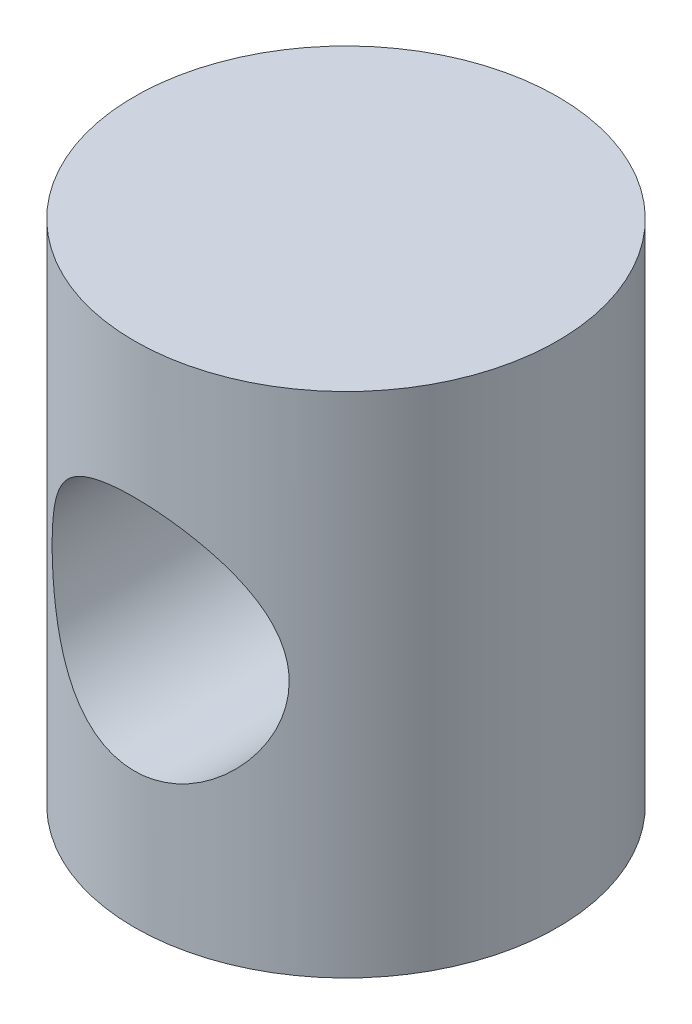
ISO-10303-21;
HEADER;
FILE_DESCRIPTION(('STEP AP214'),'2;1');
FILE_NAME('part.step','',(''),(''),'','','');
FILE_SCHEMA(('AUTOMOTIVE_DESIGN { 1 0 10303 214 1 1 1 1 }'));
ENDSEC;
DATA;
#1=APPLICATION_CONTEXT('core data for automotive mechanical design processes');
#2=APPLICATION_PROTOCOL_DEFINITION('international standard','automotive_design',2000,#1);
#3=PRODUCT_CONTEXT('',#1,'mechanical');
#4=PRODUCT('Part','Part','',(#3));
#5=PRODUCT_RELATED_PRODUCT_CATEGORY('part','',(#4));
#6=PRODUCT_DEFINITION_FORMATION('','',#4);
#7=PRODUCT_DEFINITION_CONTEXT('part definition',#1,'design');
#8=PRODUCT_DEFINITION('design','',#6,#7);
#9=PRODUCT_DEFINITION_SHAPE('','',#8);
#10=(LENGTH_UNIT() NAMED_UNIT(*) SI_UNIT(.MILLI.,.METRE.));
#11=(NAMED_UNIT(*) PLANE_ANGLE_UNIT() SI_UNIT($,.RADIAN.));
#12=(NAMED_UNIT(*) SI_UNIT($,.STERADIAN.) SOLID_ANGLE_UNIT());
#13=UNCERTAINTY_MEASURE_WITH_UNIT(LENGTH_MEASURE(1.E-05),#10,'distance_accuracy_value','');
#14=(GEOMETRIC_REPRESENTATION_CONTEXT(3) GLOBAL_UNCERTAINTY_ASSIGNED_CONTEXT((#13)) GLOBAL_UNIT_ASSIGNED_CONTEXT((#10,
#11,#12)) REPRESENTATION_CONTEXT('',''));
#15=CARTESIAN_POINT('',(0.,0.,0.));
#16=DIRECTION('',(0.,0.,1.));
#17=DIRECTION('',(1.,0.,0.));
#18=AXIS2_PLACEMENT_3D('',#15,#16,#17);
#19=CARTESIAN_POINT('',(0.,120.,0.));
#20=DIRECTION('',(0.,-1.,0.));
#21=DIRECTION('',(0.,0.,-1.));
#22=AXIS2_PLACEMENT_3D('',#19,#20,#21);
#23=CYLINDRICAL_SURFACE('',#22,50.);
#24=CARTESIAN_POINT('',(0.,88.,-50.));
#25=CARTESIAN_POINT('',(-0.725789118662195,88.0000033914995,-50.0000029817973));
#26=CARTESIAN_POINT('',(-1.45153575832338,87.9717506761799,-49.9841642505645));
#27=CARTESIAN_POINT('',(-2.89724829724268,87.8591375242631,-49.921231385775));
#28=CARTESIAN_POINT('',(-3.61721463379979,87.7747813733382,-49.8741396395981));
#29=CARTESIAN_POINT('',(-5.04594931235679,87.5510678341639,-49.7499015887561));
#30=CARTESIAN_POINT('',(-5.75471665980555,87.4117055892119,-49.6727526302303));
#31=CARTESIAN_POINT('',(-7.15594832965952,87.0797132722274,-49.4903187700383));
#32=CARTESIAN_POINT('',(-7.84841217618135,86.8870816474,-49.3850330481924));
#33=CARTESIAN_POINT('',(-9.20994156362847,86.4515776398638,-49.1492887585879));
#34=CARTESIAN_POINT('',(-9.87908556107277,86.2088976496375,-49.0189267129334));
#35=CARTESIAN_POINT('',(-11.1928842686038,85.6753204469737,-48.7357257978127));
#36=CARTESIAN_POINT('',(-11.83753920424,85.3844236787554,-48.5828871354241));
#37=CARTESIAN_POINT('',(-13.0992393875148,84.756947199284,-48.2579982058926));
#38=CARTESIAN_POINT('',(-13.7162810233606,84.4203615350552,-48.0859454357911));
#39=CARTESIAN_POINT('',(-14.9200130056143,83.7040882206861,-47.7261762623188));
#40=CARTESIAN_POINT('',(-15.5067019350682,83.3243985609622,-47.5384591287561));
#41=CARTESIAN_POINT('',(-16.6875519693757,82.4962562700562,-47.1374712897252));
#42=CARTESIAN_POINT('',(-17.2793451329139,82.044847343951,-46.92333181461));
#43=CARTESIAN_POINT('',(-18.4232468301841,81.0982277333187,-46.4861159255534));
#44=CARTESIAN_POINT('',(-18.9753538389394,80.6030153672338,-46.2630391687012));
#45=CARTESIAN_POINT('',(-20.0382856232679,79.5708061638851,-45.8126684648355));
#46=CARTESIAN_POINT('',(-20.5490700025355,79.0337694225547,-45.5853706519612));
#47=CARTESIAN_POINT('',(-21.5267247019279,77.9206281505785,-45.1319237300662));
#48=CARTESIAN_POINT('',(-21.993592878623,77.344521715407,-44.9057746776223));
#49=CARTESIAN_POINT('',(-22.9272591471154,76.0938237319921,-44.4369345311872));
#50=CARTESIAN_POINT('',(-23.3890459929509,75.4152109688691,-44.1949547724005));
#51=CARTESIAN_POINT('',(-24.2534189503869,74.0159890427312,-43.7265757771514));
#52=CARTESIAN_POINT('',(-24.6559971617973,73.2953742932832,-43.5001786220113));
#53=CARTESIAN_POINT('',(-25.3978852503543,71.816552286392,-43.0712303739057));
#54=CARTESIAN_POINT('',(-25.7372696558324,71.0583906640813,-42.8686512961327));
#55=CARTESIAN_POINT('',(-26.3493584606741,69.5081640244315,-42.4951769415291));
#56=CARTESIAN_POINT('',(-26.6220835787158,68.7161096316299,-42.3242718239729));
#57=CARTESIAN_POINT('',(-27.0462355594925,67.275874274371,-42.0541328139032));
#58=CARTESIAN_POINT('',(-27.2111271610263,66.633039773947,-41.9473870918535));
#59=CARTESIAN_POINT('',(-27.4953896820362,65.3334557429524,-41.7616149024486));
#60=CARTESIAN_POINT('',(-27.6147671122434,64.6767082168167,-41.6825844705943));
#61=CARTESIAN_POINT('',(-27.8064171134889,63.35400404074,-41.5549812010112));
#62=CARTESIAN_POINT('',(-27.8787301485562,62.6880558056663,-41.5063822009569));
#63=CARTESIAN_POINT('',(-27.975412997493,61.3510893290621,-41.4412801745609));
#64=CARTESIAN_POINT('',(-27.999781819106,60.6800709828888,-41.4247778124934));
#65=CARTESIAN_POINT('',(-28.0002155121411,59.3372353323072,-41.4244847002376));
#66=CARTESIAN_POINT('',(-27.9762244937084,58.6654180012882,-41.4407317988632));
#67=CARTESIAN_POINT('',(-27.8801784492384,57.3268082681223,-41.5054088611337));
#68=CARTESIAN_POINT('',(-27.8081232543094,56.6600158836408,-41.5538389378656));
#69=CARTESIAN_POINT('',(-27.6169023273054,55.3358264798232,-41.6811689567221));
#70=CARTESIAN_POINT('',(-27.4977103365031,54.678434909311,-41.7600858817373));
#71=CARTESIAN_POINT('',(-27.213731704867,53.3776080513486,-41.9456971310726));
#72=CARTESIAN_POINT('',(-27.0489439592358,52.7341731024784,-42.0523921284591));
#73=CARTESIAN_POINT('',(-26.6757958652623,51.4654366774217,-42.2900783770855));
#74=CARTESIAN_POINT('',(-26.467478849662,50.8401178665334,-42.4210454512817));
#75=CARTESIAN_POINT('',(-26.0091363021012,49.6098217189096,-42.7035976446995));
#76=CARTESIAN_POINT('',(-25.7591111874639,49.0048441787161,-42.8551825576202));
#77=CARTESIAN_POINT('',(-25.2192244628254,47.817379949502,-43.1750987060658));
#78=CARTESIAN_POINT('',(-24.9293534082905,47.2348986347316,-43.3434339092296));
#79=CARTESIAN_POINT('',(-24.3116286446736,46.0944117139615,-43.692913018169));
#80=CARTESIAN_POINT('',(-23.9837708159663,45.5364087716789,-43.8740583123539));
#81=CARTESIAN_POINT('',(-23.2383302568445,44.3623771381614,-44.2739809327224));
#82=CARTESIAN_POINT('',(-22.8147090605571,43.7506831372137,-44.4942516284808));
#83=CARTESIAN_POINT('',(-21.9214186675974,42.5643220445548,-44.9410818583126));
#84=CARTESIAN_POINT('',(-21.4517457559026,41.9896579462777,-45.167641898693));
#85=CARTESIAN_POINT('',(-20.4681218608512,40.8791597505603,-45.6218106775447));
#86=CARTESIAN_POINT('',(-19.9541382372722,40.3433548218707,-45.849420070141));
#87=CARTESIAN_POINT('',(-18.884249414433,39.3133725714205,-46.3003473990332));
#88=CARTESIAN_POINT('',(-18.3283424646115,38.8191969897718,-46.5236651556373));
#89=CARTESIAN_POINT('',(-17.1162371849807,37.8254358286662,-46.9840132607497));
#90=CARTESIAN_POINT('',(-16.4556365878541,37.3307272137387,-47.2200224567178));
#91=CARTESIAN_POINT('',(-15.0890270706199,36.3990426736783,-47.6743092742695));
#92=CARTESIAN_POINT('',(-14.3830143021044,35.9620716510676,-47.8925853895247));
#93=CARTESIAN_POINT('',(-12.9298720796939,35.1502383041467,-48.3051601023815));
#94=CARTESIAN_POINT('',(-12.1827627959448,34.775345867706,-48.4994703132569));
#95=CARTESIAN_POINT('',(-10.6520220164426,34.0917625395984,-48.8584908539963));
#96=CARTESIAN_POINT('',(-9.86839500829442,33.7830635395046,-49.0232048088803));
#97=CARTESIAN_POINT('',(-8.32691768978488,33.2553076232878,-49.3075322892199));
#98=CARTESIAN_POINT('',(-7.57114065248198,33.0314675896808,-49.4295056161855));
#99=CARTESIAN_POINT('',(-6.03895173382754,32.6475844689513,-49.6399921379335));
#100=CARTESIAN_POINT('',(-5.26254064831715,32.4875389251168,-49.7285066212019));
#101=CARTESIAN_POINT('',(-3.69630986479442,32.2337219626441,-49.8693798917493));
#102=CARTESIAN_POINT('',(-2.90650081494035,32.1399002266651,-49.9217661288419));
#103=CARTESIAN_POINT('',(-1.32019789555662,32.0198363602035,-49.9888690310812));
#104=CARTESIAN_POINT('',(-0.523704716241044,31.9935873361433,-50.0035895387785));
#105=CARTESIAN_POINT('',(0.976193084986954,32.0081655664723,-49.9954286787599));
#106=CARTESIAN_POINT('',(1.67970640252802,32.0415838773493,-49.976700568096));
#107=CARTESIAN_POINT('',(3.08078317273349,32.1611246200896,-49.9099238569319));
#108=CARTESIAN_POINT('',(3.77834717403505,32.2472421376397,-49.8618779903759));
#109=CARTESIAN_POINT('',(5.16256080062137,32.47111385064,-49.7376208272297));
#110=CARTESIAN_POINT('',(5.84921041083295,32.608868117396,-49.6614094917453));
#111=CARTESIAN_POINT('',(7.20702674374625,32.9344089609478,-49.4826002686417));
#112=CARTESIAN_POINT('',(7.87819297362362,33.1221971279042,-49.3800015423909));
#113=CARTESIAN_POINT('',(9.19726890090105,33.5446179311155,-49.1513569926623));
#114=CARTESIAN_POINT('',(9.84528666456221,33.77898582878,-49.0254439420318));
#115=CARTESIAN_POINT('',(11.1184602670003,34.2929743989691,-48.7524743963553));
#116=CARTESIAN_POINT('',(11.743616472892,34.572594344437,-48.605418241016));
#117=CARTESIAN_POINT('',(12.9682360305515,35.174800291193,-48.29310778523));
#118=CARTESIAN_POINT('',(13.567695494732,35.4973927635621,-48.1278507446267));
#119=CARTESIAN_POINT('',(14.7383862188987,36.1831935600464,-47.7823454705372));
#120=CARTESIAN_POINT('',(15.3096157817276,36.5464043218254,-47.6020963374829));
#121=CARTESIAN_POINT('',(16.4793269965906,37.3507976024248,-47.2107023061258));
#122=CARTESIAN_POINT('',(17.0745134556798,37.7961592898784,-46.998290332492));
#123=CARTESIAN_POINT('',(18.2256080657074,38.7308442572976,-46.5639959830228));
#124=CARTESIAN_POINT('',(18.7815138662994,39.2201701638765,-46.3421130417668));
#125=CARTESIAN_POINT('',(19.852477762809,40.240778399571,-45.8935345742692));
#126=CARTESIAN_POINT('',(20.3674927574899,40.7721038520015,-45.6668342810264));
#127=CARTESIAN_POINT('',(21.3540006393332,41.8739540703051,-45.2139502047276));
#128=CARTESIAN_POINT('',(21.8254916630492,42.444480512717,-44.9877664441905));
#129=CARTESIAN_POINT('',(22.7694931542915,43.6838020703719,-44.5180435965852));
#130=CARTESIAN_POINT('',(23.2370200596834,44.3566484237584,-44.275142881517));
#131=CARTESIAN_POINT('',(24.1134067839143,45.7445710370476,-43.8040094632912));
#132=CARTESIAN_POINT('',(24.5222587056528,46.4596529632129,-43.5757787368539));
#133=CARTESIAN_POINT('',(25.2772981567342,47.9277693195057,-43.1421786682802));
#134=CARTESIAN_POINT('',(25.6235566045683,48.6807595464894,-42.9367835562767));
#135=CARTESIAN_POINT('',(26.2500309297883,50.2211145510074,-42.5566718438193));
#136=CARTESIAN_POINT('',(26.5302667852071,51.0084688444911,-42.3819459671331));
#137=CARTESIAN_POINT('',(26.9692144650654,52.4435274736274,-42.1036105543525));
#138=CARTESIAN_POINT('',(27.1410880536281,53.0858300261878,-41.9927720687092));
#139=CARTESIAN_POINT('',(27.4393069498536,54.3849847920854,-41.7985191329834));
#140=CARTESIAN_POINT('',(27.565658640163,55.0418349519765,-41.715100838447));
#141=CARTESIAN_POINT('',(27.7711708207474,56.3654177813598,-41.5785682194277));
#142=CARTESIAN_POINT('',(27.8503729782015,57.032141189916,-41.5254271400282));
#143=CARTESIAN_POINT('',(27.9606679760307,58.37137019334,-41.451242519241));
#144=CARTESIAN_POINT('',(27.9917599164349,59.0438758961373,-41.4301995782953));
#145=CARTESIAN_POINT('',(28.0053842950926,60.390579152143,-41.4209913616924));
#146=CARTESIAN_POINT('',(27.9878465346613,61.0647777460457,-41.4328736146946));
#147=CARTESIAN_POINT('',(27.9043208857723,62.4087825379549,-41.4891718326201));
#148=CARTESIAN_POINT('',(27.8383328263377,63.0785887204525,-41.5335879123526));
#149=CARTESIAN_POINT('',(27.6587942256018,64.4093274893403,-41.6533635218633));
#150=CARTESIAN_POINT('',(27.5452179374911,65.0702550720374,-41.7287398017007));
#151=CARTESIAN_POINT('',(27.2719737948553,66.3785654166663,-41.9078281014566));
#152=CARTESIAN_POINT('',(27.1123049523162,67.0259478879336,-42.0115407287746));
#153=CARTESIAN_POINT('',(26.7499640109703,68.2990644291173,-42.2431682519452));
#154=CARTESIAN_POINT('',(26.5475981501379,68.9249175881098,-42.3709101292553));
#155=CARTESIAN_POINT('',(26.1011516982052,70.1567264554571,-42.647376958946));
#156=CARTESIAN_POINT('',(25.8570716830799,70.7626824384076,-42.7961016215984));
#157=CARTESIAN_POINT('',(25.3290640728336,71.9524998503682,-43.1107054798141));
#158=CARTESIAN_POINT('',(25.0451273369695,72.5363561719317,-43.2765886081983));
#159=CARTESIAN_POINT('',(24.439259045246,73.6799651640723,-43.6216018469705));
#160=CARTESIAN_POINT('',(24.1173233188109,74.2397151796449,-43.8007334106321));
#161=CARTESIAN_POINT('',(23.3854720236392,75.4165488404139,-44.196356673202));
#162=CARTESIAN_POINT('',(22.9696202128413,76.0294297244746,-44.4143907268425));
#163=CARTESIAN_POINT('',(22.0920623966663,77.2187997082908,-44.8573559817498));
#164=CARTESIAN_POINT('',(21.6303527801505,77.7952859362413,-45.0822877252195));
#165=CARTESIAN_POINT('',(20.6628408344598,78.9101056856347,-45.5338574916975));
#166=CARTESIAN_POINT('',(20.1570059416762,79.448410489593,-45.7604966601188));
#167=CARTESIAN_POINT('',(19.1035649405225,80.4841272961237,-46.2101920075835));
#168=CARTESIAN_POINT('',(18.5559569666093,80.9815374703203,-46.433248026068));
#169=CARTESIAN_POINT('',(17.3586614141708,81.9852727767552,-46.8949075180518));
#170=CARTESIAN_POINT('',(16.7043681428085,82.4865763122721,-47.1325277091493));
#171=CARTESIAN_POINT('',(15.3499988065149,83.432020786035,-47.5908461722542));
#172=CARTESIAN_POINT('',(14.6499187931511,83.8761567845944,-47.8115429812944));
#173=CARTESIAN_POINT('',(13.2081222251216,84.7029493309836,-48.2297478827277));
#174=CARTESIAN_POINT('',(12.4664240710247,85.0856327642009,-48.4272661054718));
#175=CARTESIAN_POINT('',(10.9458750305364,85.7854223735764,-48.7934325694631));
#176=CARTESIAN_POINT('',(10.167028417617,86.1025360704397,-48.9620841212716));
#177=CARTESIAN_POINT('',(8.62943619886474,86.6487282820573,-49.2555092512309));
#178=CARTESIAN_POINT('',(7.87265035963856,86.8821751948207,-49.3824157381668));
#179=CARTESIAN_POINT('',(6.33739841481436,87.2849228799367,-49.6028079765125));
#180=CARTESIAN_POINT('',(5.55893316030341,87.4542261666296,-49.6962950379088));
#181=CARTESIAN_POINT('',(3.9875414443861,87.726067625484,-49.8469861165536));
#182=CARTESIAN_POINT('',(3.19462615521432,87.8286553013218,-49.904217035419));
#183=CARTESIAN_POINT('',(1.60112291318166,87.9656167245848,-49.9807207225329));
#184=CARTESIAN_POINT('',(0.800535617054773,87.9999962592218,-49.9999967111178));
#185=CARTESIAN_POINT('',(0.,88.,-50.));
#186=B_SPLINE_CURVE_WITH_KNOTS('',3,(#24,#25,#26,#27,#28,#29,#30,#31,#32,#33,#34,#35,#36,#37,
#38,#39,#40,#41,#42,#43,#44,#45,#46,#47,#48,#49,#50,#51,#52,#53,#54,#55,#56,#57,#58,#59,#60,#61,
#62,#63,#64,#65,#66,#67,#68,#69,#70,#71,#72,#73,#74,#75,#76,#77,#78,#79,#80,#81,#82,#83,#84,#85,
#86,#87,#88,#89,#90,#91,#92,#93,#94,#95,#96,#97,#98,#99,#100,#101,#102,#103,#104,#105,#106,#107,
#108,#109,#110,#111,#112,#113,#114,#115,#116,#117,#118,#119,#120,#121,#122,#123,#124,#125,#126,
#127,#128,#129,#130,#131,#132,#133,#134,#135,#136,#137,#138,#139,#140,#141,#142,#143,#144,#145,
#146,#147,#148,#149,#150,#151,#152,#153,#154,#155,#156,#157,#158,#159,#160,#161,#162,#163,#164,
#165,#166,#167,#168,#169,#170,#171,#172,#173,#174,#175,#176,#177,#178,#179,#180,#181,#182,#183,
#184,#185),.UNSPECIFIED.,.T.,.F.,(4,2,2,2,2,2,2,2,2,2,2,2,2,2,2,2,2,2,2,2,2,2,2,2,2,2,2,2,2,2,2,
2,2,2,2,2,2,2,2,2,2,2,2,2,2,2,2,2,2,2,2,2,2,2,2,2,2,2,2,2,2,2,2,2,2,2,2,2,2,2,2,2,2,2,2,2,2,2,2,
2,4),(0.,2.17657722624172,4.35298820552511,6.52959139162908,8.70625803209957,10.8747082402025,
13.0431384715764,15.2118515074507,17.3806656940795,19.7017671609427,22.0229577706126,
24.3463907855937,26.6699371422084,29.23403741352,31.7984795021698,34.3598777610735,
36.9204788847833,38.9349215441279,40.9490759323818,42.9614963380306,44.9739583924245,
46.9887475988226,49.0035438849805,51.0194641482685,53.0354332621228,55.0494049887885,
57.0633565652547,59.0777863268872,61.0924347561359,63.4179938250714,65.7437406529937,
68.0712155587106,70.3987877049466,72.9706775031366,75.5427855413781,78.1136422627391,
80.6841838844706,83.0736326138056,85.4629893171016,87.8505286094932,90.2378243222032,
92.3489255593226,94.4598299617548,96.5707372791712,98.6817116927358,100.781014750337,
102.880284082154,104.979869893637,107.079581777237,109.396536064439,111.713628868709,
114.033132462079,116.352735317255,118.913336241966,121.474281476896,124.032306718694,
126.589556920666,128.609704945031,130.629569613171,132.647646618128,134.665761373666,
136.686790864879,138.707827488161,140.729958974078,142.752133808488,144.760270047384,
146.768378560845,148.776948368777,150.785738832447,153.099598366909,155.413640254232,
157.729404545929,160.045272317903,162.615506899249,165.185963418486,167.755292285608,
170.324326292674,172.727144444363,175.1298683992,177.530807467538,179.931542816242),.UNSPECIFIED.);
#187=CARTESIAN_POINT('',(0.,88.,-50.));
#188=VERTEX_POINT('',#187);
#189=EDGE_CURVE('E33',#188,#188,#186,.T.);
#190=ORIENTED_EDGE('',*,*,#189,.T.);
#191=EDGE_LOOP('',(#190));
#192=FACE_BOUND('',#191,.T.);
#193=CARTESIAN_POINT('',(28.,60.,41.424630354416));
#194=CARTESIAN_POINT('',(27.9999924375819,59.2849118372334,41.4246407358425));
#195=CARTESIAN_POINT('',(27.9725588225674,58.5696674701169,41.4432197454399));
#196=CARTESIAN_POINT('',(27.8632461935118,57.1451396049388,41.5167879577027));
#197=CARTESIAN_POINT('',(27.7813510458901,56.4358579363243,41.5717879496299));
#198=CARTESIAN_POINT('',(27.5642480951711,55.0280623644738,41.7160542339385));
#199=CARTESIAN_POINT('',(27.4289671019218,54.3295646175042,41.8053675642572));
#200=CARTESIAN_POINT('',(27.1070201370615,52.9493467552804,42.0148334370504));
#201=CARTESIAN_POINT('',(26.9203563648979,52.2676259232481,42.1349846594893));
#202=CARTESIAN_POINT('',(26.499299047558,50.9293851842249,42.4010456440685));
#203=CARTESIAN_POINT('',(26.2652244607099,50.2727300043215,42.5467824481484));
#204=CARTESIAN_POINT('',(25.7509466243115,48.9831637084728,42.8599968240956));
#205=CARTESIAN_POINT('',(25.4707430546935,48.3502527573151,43.0274745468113));
#206=CARTESIAN_POINT('',(24.8664521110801,47.1106604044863,43.3795088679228));
#207=CARTESIAN_POINT('',(24.5423608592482,46.5039813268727,43.5640669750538));
#208=CARTESIAN_POINT('',(23.8524088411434,45.3189665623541,43.9456254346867));
#209=CARTESIAN_POINT('',(23.4865457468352,44.7406324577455,44.1426264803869));
#210=CARTESIAN_POINT('',(22.6743775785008,43.5548835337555,44.5657228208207));
#211=CARTESIAN_POINT('',(22.2236593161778,42.9508022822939,44.792699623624));
#212=CARTESIAN_POINT('',(21.2758566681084,41.7817607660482,45.2505794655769));
#213=CARTESIAN_POINT('',(20.7787698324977,41.2168025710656,45.4814827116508));
#214=CARTESIAN_POINT('',(19.7400942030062,40.1280340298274,45.9418275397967));
#215=CARTESIAN_POINT('',(19.1984795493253,39.6042479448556,46.1712681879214));
#216=CARTESIAN_POINT('',(18.0731575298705,38.6007156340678,46.623263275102));
#217=CARTESIAN_POINT('',(17.4894484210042,38.1209712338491,46.8458174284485));
#218=CARTESIAN_POINT('',(16.227780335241,37.1671385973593,47.2984962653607));
#219=CARTESIAN_POINT('',(15.5460687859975,36.6974611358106,47.5274940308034));
#220=CARTESIAN_POINT('',(14.1388297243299,35.8177328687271,47.9649496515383));
#221=CARTESIAN_POINT('',(13.4132988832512,35.4076866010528,48.1734059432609));
#222=CARTESIAN_POINT('',(11.92320980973,34.6517354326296,48.5636672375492));
#223=CARTESIAN_POINT('',(11.1586754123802,34.3057919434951,48.7454882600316));
#224=CARTESIAN_POINT('',(9.59559650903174,33.6820921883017,49.0771072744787));
#225=CARTESIAN_POINT('',(8.79705674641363,33.4043264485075,49.2269097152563));
#226=CARTESIAN_POINT('',(7.24208156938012,32.9416775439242,49.4784648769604));
#227=CARTESIAN_POINT('',(6.4878919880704,32.7508795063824,49.5832327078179));
#228=CARTESIAN_POINT('',(4.96243965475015,32.4322443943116,49.759053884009));
#229=CARTESIAN_POINT('',(4.19117779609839,32.3044040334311,49.8301089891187));
#230=CARTESIAN_POINT('',(2.63872833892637,32.1136530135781,49.9363802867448));
#231=CARTESIAN_POINT('',(1.85754767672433,32.0506992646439,49.9716202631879));
#232=CARTESIAN_POINT('',(0.291891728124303,31.9905667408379,50.0052766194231));
#233=CARTESIAN_POINT('',(-0.492583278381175,31.9933824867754,50.0036960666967));
#234=CARTESIAN_POINT('',(-1.97250673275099,32.0608355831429,49.9659517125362));
#235=CARTESIAN_POINT('',(-2.66837180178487,32.118726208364,49.9335621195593));
#236=CARTESIAN_POINT('',(-4.05190722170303,32.2859695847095,49.8403715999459));
#237=CARTESIAN_POINT('',(-4.73957829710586,32.3953177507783,49.7795732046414));
#238=CARTESIAN_POINT('',(-6.10206482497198,32.6641801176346,49.630983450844));
#239=CARTESIAN_POINT('',(-6.77687980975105,32.8236961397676,49.5431911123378));
#240=CARTESIAN_POINT('',(-8.10938655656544,33.1911292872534,49.3425969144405));
#241=CARTESIAN_POINT('',(-8.76707764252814,33.3990483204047,49.2297940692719));
#242=CARTESIAN_POINT('',(-10.0679294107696,33.8634644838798,48.9804016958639));
#243=CARTESIAN_POINT('',(-10.7108835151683,34.1204193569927,48.843589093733));
#244=CARTESIAN_POINT('',(-11.9721685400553,34.6791983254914,48.5498354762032));
#245=CARTESIAN_POINT('',(-12.5904995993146,34.9810221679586,48.3928945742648));
#246=CARTESIAN_POINT('',(-13.7998974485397,35.6272078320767,48.0620013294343));
#247=CARTESIAN_POINT('',(-14.3909588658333,35.9715779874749,47.8880456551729));
#248=CARTESIAN_POINT('',(-15.5433943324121,36.7004757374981,47.5264946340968));
#249=CARTESIAN_POINT('',(-16.1047665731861,37.0850057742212,47.3388984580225));
#250=CARTESIAN_POINT('',(-17.2560858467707,37.9365646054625,46.9322932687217));
#251=CARTESIAN_POINT('',(-17.8423493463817,38.4080146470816,46.7121023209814));
#252=CARTESIAN_POINT('',(-18.9735087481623,39.3949168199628,46.2641989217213));
#253=CARTESIAN_POINT('',(-19.5184020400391,39.9103717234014,46.036485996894));
#254=CARTESIAN_POINT('',(-20.5651976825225,40.9832984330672,45.5784965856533));
#255=CARTESIAN_POINT('',(-21.0670557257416,41.5408124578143,45.3482177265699));
#256=CARTESIAN_POINT('',(-22.0250305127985,42.6950699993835,44.890754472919));
#257=CARTESIAN_POINT('',(-22.4811450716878,43.2918153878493,44.6635702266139));
#258=CARTESIAN_POINT('',(-23.3856892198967,44.5797171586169,44.1971948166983));
#259=CARTESIAN_POINT('',(-23.8294329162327,45.2744877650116,43.9588605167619));
#260=CARTESIAN_POINT('',(-24.6562258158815,46.70514647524,43.5005066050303));
#261=CARTESIAN_POINT('',(-25.0392696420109,47.4410382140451,43.2804886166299));
#262=CARTESIAN_POINT('',(-25.7405735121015,48.9494821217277,42.8671029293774));
#263=CARTESIAN_POINT('',(-26.0588928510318,49.7219999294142,42.6737108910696));
#264=CARTESIAN_POINT('',(-26.6271043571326,51.2994411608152,42.3214989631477));
#265=CARTESIAN_POINT('',(-26.877007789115,52.1043592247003,42.1626733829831));
#266=CARTESIAN_POINT('',(-27.2873093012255,53.674834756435,41.8981805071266));
#267=CARTESIAN_POINT('',(-27.4532671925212,54.4383918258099,41.7892777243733));
#268=CARTESIAN_POINT('',(-27.7211704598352,55.9813456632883,41.6120497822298));
#269=CARTESIAN_POINT('',(-27.823120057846,56.7607413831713,41.5437219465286));
#270=CARTESIAN_POINT('',(-27.9610257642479,58.3271230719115,41.4510313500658));
#271=CARTESIAN_POINT('',(-27.9970531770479,59.1140999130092,41.4266210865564));
#272=CARTESIAN_POINT('',(-28.0025983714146,60.6883488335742,41.4228751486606));
#273=CARTESIAN_POINT('',(-27.9721241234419,61.4756208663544,41.4435340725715));
#274=CARTESIAN_POINT('',(-27.8550742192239,62.9219206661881,41.522267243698));
#275=CARTESIAN_POINT('',(-27.7778336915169,63.5820744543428,41.5741077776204));
#276=CARTESIAN_POINT('',(-27.5772600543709,64.8922158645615,41.7074243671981));
#277=CARTESIAN_POINT('',(-27.4539327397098,65.542204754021,41.7888966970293));
#278=CARTESIAN_POINT('',(-27.1626465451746,66.8282951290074,41.9788134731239));
#279=CARTESIAN_POINT('',(-26.9946704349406,67.4643911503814,42.087268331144));
#280=CARTESIAN_POINT('',(-26.6159075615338,68.7191167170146,42.3278128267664));
#281=CARTESIAN_POINT('',(-26.4051177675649,69.3377450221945,42.4599041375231));
#282=CARTESIAN_POINT('',(-25.9333253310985,70.5792844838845,42.7497636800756));
#283=CARTESIAN_POINT('',(-25.6706417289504,71.2013639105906,42.9083520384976));
#284=CARTESIAN_POINT('',(-25.103122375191,72.4211863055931,43.2428225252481));
#285=CARTESIAN_POINT('',(-24.7982820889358,73.0189266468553,43.4187065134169));
#286=CARTESIAN_POINT('',(-24.1483547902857,74.1881815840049,43.7835109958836));
#287=CARTESIAN_POINT('',(-23.803255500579,74.7596881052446,43.9724354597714));
#288=CARTESIAN_POINT('',(-23.0746882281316,75.8745801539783,44.3590900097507));
#289=CARTESIAN_POINT('',(-22.6912173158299,76.4179635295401,44.5568207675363));
#290=CARTESIAN_POINT('',(-21.8209988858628,77.5625408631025,44.9901953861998));
#291=CARTESIAN_POINT('',(-21.327663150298,78.1584154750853,45.2266971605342));
#292=CARTESIAN_POINT('',(-20.2934847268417,79.3073028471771,45.7000868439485));
#293=CARTESIAN_POINT('',(-19.7526376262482,79.8603116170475,45.9369747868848));
#294=CARTESIAN_POINT('',(-18.6254176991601,80.921116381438,46.4054578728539));
#295=CARTESIAN_POINT('',(-18.0390164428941,81.4288837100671,46.6370495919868));
#296=CARTESIAN_POINT('',(-16.8234428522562,82.3958687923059,47.0891950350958));
#297=CARTESIAN_POINT('',(-16.1942701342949,82.8550861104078,47.3097486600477));
#298=CARTESIAN_POINT('',(-14.859091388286,83.7463160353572,47.7464989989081));
#299=CARTESIAN_POINT('',(-14.1507518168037,84.1753124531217,47.9617406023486));
#300=CARTESIAN_POINT('',(-12.6933096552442,84.97136966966,48.3678828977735));
#301=CARTESIAN_POINT('',(-11.9442046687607,85.3384268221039,48.5587821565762));
#302=CARTESIAN_POINT('',(-10.410843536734,86.0060161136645,48.9104530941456));
#303=CARTESIAN_POINT('',(-9.62661825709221,86.3066053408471,49.071250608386));
#304=CARTESIAN_POINT('',(-8.02854884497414,86.8374919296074,49.3578867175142));
#305=CARTESIAN_POINT('',(-7.21470931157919,87.0678001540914,49.4837307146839));
#306=CARTESIAN_POINT('',(-5.65004793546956,87.4345453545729,49.6853439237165));
#307=CARTESIAN_POINT('',(-4.90141206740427,87.5782266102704,49.7649455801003));
#308=CARTESIAN_POINT('',(-3.39214477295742,87.8042337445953,49.890545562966));
#309=CARTESIAN_POINT('',(-2.63151418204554,87.8865638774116,49.9365462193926));
#310=CARTESIAN_POINT('',(-1.10512348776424,87.9886322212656,49.9936170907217));
#311=CARTESIAN_POINT('',(-0.339366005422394,88.0084002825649,50.0047039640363));
#312=CARTESIAN_POINT('',(1.19087214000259,87.9851255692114,49.9916706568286));
#313=CARTESIAN_POINT('',(1.95535287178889,87.9420862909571,49.9675524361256));
#314=CARTESIAN_POINT('',(3.40431771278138,87.8008874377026,49.8887396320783));
#315=CARTESIAN_POINT('',(4.08952701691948,87.7083284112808,49.837153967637));
#316=CARTESIAN_POINT('',(5.44867743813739,87.4733955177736,49.706919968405));
#317=CARTESIAN_POINT('',(6.12261944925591,87.3310256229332,49.6282737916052));
#318=CARTESIAN_POINT('',(7.4549813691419,86.9980527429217,49.4456822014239));
#319=CARTESIAN_POINT('',(8.11340040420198,86.8074470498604,49.3417353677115));
#320=CARTESIAN_POINT('',(9.410875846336,86.3799550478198,49.1107899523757));
#321=CARTESIAN_POINT('',(10.049931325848,86.1430665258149,48.9837902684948));
#322=CARTESIAN_POINT('',(11.3252270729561,85.6169862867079,48.7050167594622));
#323=CARTESIAN_POINT('',(11.9607376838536,85.3263761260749,48.5525858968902));
#324=CARTESIAN_POINT('',(13.2045314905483,84.7007088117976,48.2291749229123));
#325=CARTESIAN_POINT('',(13.8128144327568,84.3656512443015,48.0581946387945));
#326=CARTESIAN_POINT('',(14.9997374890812,83.6534788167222,47.7010704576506));
#327=CARTESIAN_POINT('',(15.5783700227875,83.2763532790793,47.5149227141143));
#328=CARTESIAN_POINT('',(16.7037856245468,82.4823882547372,47.1310620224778));
#329=CARTESIAN_POINT('',(17.2505658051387,82.0655451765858,46.9333480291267));
#330=CARTESIAN_POINT('',(18.076498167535,81.3866124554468,46.6191021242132));
#331=CARTESIAN_POINT('',(18.3673217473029,81.1373586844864,46.5052266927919));
#332=CARTESIAN_POINT('',(18.9380616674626,80.6275592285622,46.2757431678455));
#333=CARTESIAN_POINT('',(19.217980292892,80.3670159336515,46.1601354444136));
#334=CARTESIAN_POINT('',(20.0411166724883,79.5687992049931,45.8116639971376));
#335=CARTESIAN_POINT('',(20.5677234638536,79.01453190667,45.5771487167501));
#336=CARTESIAN_POINT('',(21.5747186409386,77.8638435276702,45.1092040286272));
#337=CARTESIAN_POINT('',(22.0550487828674,77.2673709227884,44.8757763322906));
#338=CARTESIAN_POINT('',(22.966475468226,76.0352168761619,44.4162297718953));
#339=CARTESIAN_POINT('',(23.3975713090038,75.3995348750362,44.1901110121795));
#340=CARTESIAN_POINT('',(24.2380668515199,74.0427687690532,43.7351251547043));
#341=CARTESIAN_POINT('',(24.6434713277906,73.3188489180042,43.5073033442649));
#342=CARTESIAN_POINT('',(25.3908898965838,71.8319502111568,43.0753894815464));
#343=CARTESIAN_POINT('',(25.7328928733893,71.0689645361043,42.8713015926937));
#344=CARTESIAN_POINT('',(26.3485945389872,69.5106047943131,42.4956631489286));
#345=CARTESIAN_POINT('',(26.6224744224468,68.7153233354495,42.3240265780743));
#346=CARTESIAN_POINT('',(27.0988974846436,67.0965140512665,42.0205891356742));
#347=CARTESIAN_POINT('',(27.3014849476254,66.2730041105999,41.8887635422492));
#348=CARTESIAN_POINT('',(27.5547674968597,64.9941077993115,41.7222438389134));
#349=CARTESIAN_POINT('',(27.6322521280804,64.5459975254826,41.670912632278));
#350=CARTESIAN_POINT('',(27.7654401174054,63.6451985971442,41.5822896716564));
#351=CARTESIAN_POINT('',(27.8211469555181,63.1925106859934,41.544995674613));
#352=CARTESIAN_POINT('',(27.9104263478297,62.2839605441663,41.4850695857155));
#353=CARTESIAN_POINT('',(27.943997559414,61.8280981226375,41.4624383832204));
#354=CARTESIAN_POINT('',(27.9887858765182,60.9148450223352,41.4322160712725));
#355=CARTESIAN_POINT('',(28.0000048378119,60.4574544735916,41.4246237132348));
#356=CARTESIAN_POINT('',(28.,60.,41.424630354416));
#357=B_SPLINE_CURVE_WITH_KNOTS('',3,(#193,#194,#195,#196,#197,#198,#199,#200,#201,#202,#203,
#204,#205,#206,#207,#208,#209,#210,#211,#212,#213,#214,#215,#216,#217,#218,#219,#220,#221,#222,
#223,#224,#225,#226,#227,#228,#229,#230,#231,#232,#233,#234,#235,#236,#237,#238,#239,#240,#241,
#242,#243,#244,#245,#246,#247,#248,#249,#250,#251,#252,#253,#254,#255,#256,#257,#258,#259,#260,
#261,#262,#263,#264,#265,#266,#267,#268,#269,#270,#271,#272,#273,#274,#275,#276,#277,#278,#279,
#280,#281,#282,#283,#284,#285,#286,#287,#288,#289,#290,#291,#292,#293,#294,#295,#296,#297,#298,
#299,#300,#301,#302,#303,#304,#305,#306,#307,#308,#309,#310,#311,#312,#313,#314,#315,#316,#317,
#318,#319,#320,#321,#322,#323,#324,#325,#326,#327,#328,#329,#330,#331,#332,#333,#334,#335,#336,
#337,#338,#339,#340,#341,#342,#343,#344,#345,#346,#347,#348,#349,#350,#351,#352,#353,#354,#355,
#356),.UNSPECIFIED.,.T.,.F.,(4,2,2,2,2,2,2,2,2,2,2,2,2,2,2,2,2,2,2,2,2,2,2,2,2,2,2,2,2,2,2,2,2,
2,2,2,2,2,2,2,2,2,2,2,2,2,2,2,2,2,2,2,2,2,2,2,2,2,2,2,2,2,2,2,2,2,2,2,2,2,2,2,2,2,2,2,2,2,2,2,2,
4),(0.,2.14477776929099,4.29019118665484,6.43855616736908,8.58682920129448,10.7211029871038,
12.8553915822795,14.9898688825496,17.124465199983,19.4834460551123,21.84255161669,
24.2030370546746,26.563620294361,29.1370607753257,31.7106969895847,34.2827788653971,
36.8545031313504,39.2061210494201,41.557616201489,43.9075487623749,46.2572855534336,
48.3518525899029,50.4462330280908,52.5406895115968,54.6352285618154,56.7503715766,
58.8655026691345,60.981048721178,63.0967234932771,65.4458821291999,67.7951888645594,
70.1468860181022,72.4986954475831,75.0698896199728,77.641311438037,80.2103668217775,
82.7789989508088,85.1422045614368,87.5052542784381,89.8657464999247,92.2259558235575,
94.2236739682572,96.2211410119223,98.2193800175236,100.217760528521,102.296659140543,
104.375781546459,106.455539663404,108.535456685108,110.959661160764,113.384091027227,
115.81004629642,118.2360233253,120.799472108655,123.363071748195,125.92446093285,
128.485454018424,130.781621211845,133.077629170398,135.372541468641,137.667326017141,
139.744987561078,141.82248345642,143.900096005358,145.977807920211,148.121298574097,
150.264809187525,152.408865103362,154.553115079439,155.751609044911,156.949850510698,
159.346298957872,161.745725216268,164.145185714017,166.723019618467,169.301305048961,
171.87265757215,174.442410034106,175.814712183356,177.186794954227,178.558960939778,
179.931012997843),.UNSPECIFIED.);
#358=CARTESIAN_POINT('',(28.,60.,41.424630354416));
#359=VERTEX_POINT('',#358);
#360=EDGE_CURVE('E46',#359,#359,#357,.T.);
#361=ORIENTED_EDGE('',*,*,#360,.T.);
#362=EDGE_LOOP('',(#361));
#363=FACE_BOUND('',#362,.T.);
#364=CARTESIAN_POINT('',(0.,120.,0.));
#365=DIRECTION('',(0.,1.,0.));
#366=DIRECTION('',(0.,0.,1.));
#367=AXIS2_PLACEMENT_3D('',#364,#365,#366);
#368=CIRCLE('',#367,50.);
#369=CARTESIAN_POINT('',(0.,120.,50.));
#370=VERTEX_POINT('',#369);
#371=EDGE_CURVE('E10',#370,#370,#368,.T.);
#372=ORIENTED_EDGE('',*,*,#371,.F.);
#373=EDGE_LOOP('',(#372));
#374=FACE_BOUND('',#373,.T.);
#375=CARTESIAN_POINT('',(0.,0.,0.));
#376=DIRECTION('',(0.,1.,0.));
#377=DIRECTION('',(0.,0.,1.));
#378=AXIS2_PLACEMENT_3D('',#375,#376,#377);
#379=CIRCLE('',#378,50.);
#380=CARTESIAN_POINT('',(0.,0.,50.));
#381=VERTEX_POINT('',#380);
#382=EDGE_CURVE('E40',#381,#381,#379,.T.);
#383=ORIENTED_EDGE('',*,*,#382,.T.);
#384=EDGE_LOOP('',(#383));
#385=FACE_BOUND('',#384,.T.);
#386=ADVANCED_FACE('F29',(#192,#363,#374,#385),#23,.T.);
#387=CARTESIAN_POINT('',(0.,120.,0.));
#388=DIRECTION('',(0.,1.,0.));
#389=DIRECTION('',(0.,0.,1.));
#390=AXIS2_PLACEMENT_3D('',#387,#388,#389);
#391=PLANE('',#390);
#392=ORIENTED_EDGE('',*,*,#371,.T.);
#393=EDGE_LOOP('',(#392));
#394=FACE_BOUND('',#393,.T.);
#395=ADVANCED_FACE('F56',(#394),#391,.T.);
#396=CARTESIAN_POINT('',(0.,0.,0.));
#397=DIRECTION('',(0.,1.,0.));
#398=DIRECTION('',(0.,0.,1.));
#399=AXIS2_PLACEMENT_3D('',#396,#397,#398);
#400=PLANE('',#399);
#401=ORIENTED_EDGE('',*,*,#382,.F.);
#402=EDGE_LOOP('',(#401));
#403=FACE_BOUND('',#402,.T.);
#404=ADVANCED_FACE('F54',(#403),#400,.F.);
#405=CARTESIAN_POINT('',(0.,60.,-55.));
#406=DIRECTION('',(0.,0.,1.));
#407=DIRECTION('',(1.,0.,0.));
#408=AXIS2_PLACEMENT_3D('',#405,#406,#407);
#409=CYLINDRICAL_SURFACE('',#408,28.);
#410=ORIENTED_EDGE('',*,*,#360,.F.);
#411=EDGE_LOOP('',(#410));
#412=FACE_BOUND('',#411,.T.);
#413=ORIENTED_EDGE('',*,*,#189,.F.);
#414=EDGE_LOOP('',(#413));
#415=FACE_BOUND('',#414,.T.);
#416=ADVANCED_FACE('F50',(#412,#415),#409,.F.);
#417=CLOSED_SHELL('',(#386,#395,#404,#416));
#418=MANIFOLD_SOLID_BREP('B2',#417);
#419=ADVANCED_BREP_SHAPE_REPRESENTATION('',(#18,#418),#14);
#420=SHAPE_DEFINITION_REPRESENTATION(#9,#419);
ENDSEC;
END-ISO-10303-21;
